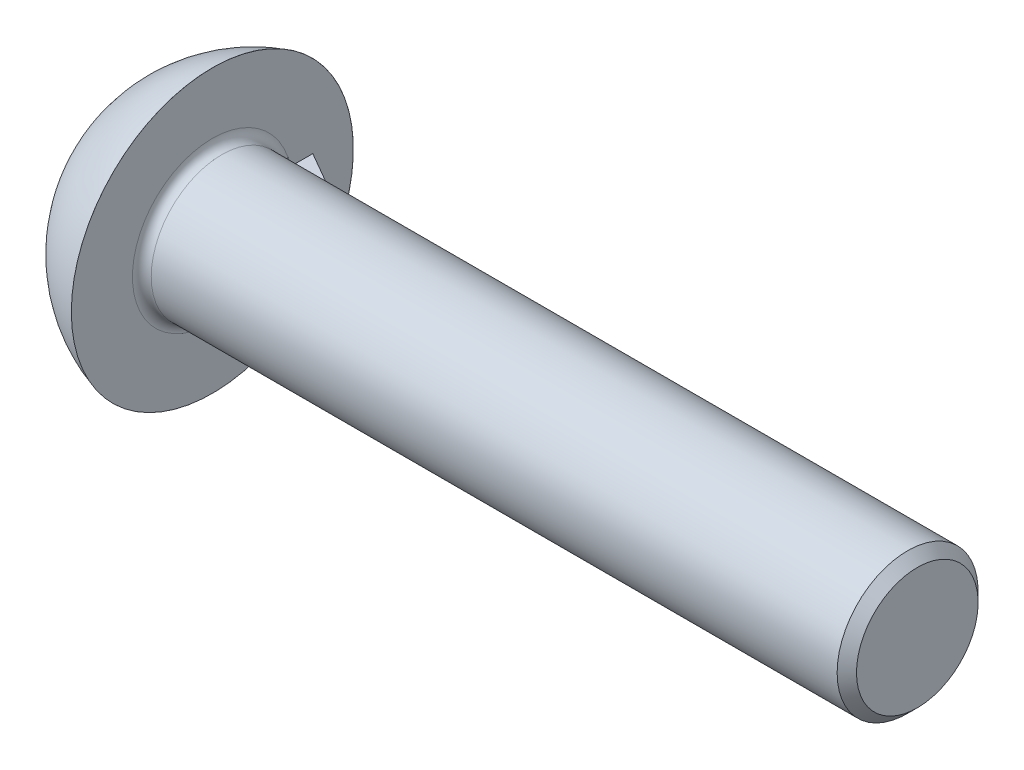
ISO-10303-21;
HEADER;
FILE_DESCRIPTION(('STEP AP214'),'2;1');
FILE_NAME('part.step','',(''),(''),'','','');
FILE_SCHEMA(('AUTOMOTIVE_DESIGN { 1 0 10303 214 1 1 1 1 }'));
ENDSEC;
DATA;
#1=APPLICATION_CONTEXT('core data for automotive mechanical design processes');
#2=APPLICATION_PROTOCOL_DEFINITION('international standard','automotive_design',2000,#1);
#3=PRODUCT_CONTEXT('',#1,'mechanical');
#4=PRODUCT('Part','Part','',(#3));
#5=PRODUCT_RELATED_PRODUCT_CATEGORY('part','',(#4));
#6=PRODUCT_DEFINITION_FORMATION('','',#4);
#7=PRODUCT_DEFINITION_CONTEXT('part definition',#1,'design');
#8=PRODUCT_DEFINITION('design','',#6,#7);
#9=PRODUCT_DEFINITION_SHAPE('','',#8);
#10=(LENGTH_UNIT() NAMED_UNIT(*) SI_UNIT(.MILLI.,.METRE.));
#11=(NAMED_UNIT(*) PLANE_ANGLE_UNIT() SI_UNIT($,.RADIAN.));
#12=(NAMED_UNIT(*) SI_UNIT($,.STERADIAN.) SOLID_ANGLE_UNIT());
#13=UNCERTAINTY_MEASURE_WITH_UNIT(LENGTH_MEASURE(1.E-05),#10,'distance_accuracy_value','');
#14=(GEOMETRIC_REPRESENTATION_CONTEXT(3) GLOBAL_UNCERTAINTY_ASSIGNED_CONTEXT((#13)) GLOBAL_UNIT_ASSIGNED_CONTEXT((#10,
#11,#12)) REPRESENTATION_CONTEXT('',''));
#15=CARTESIAN_POINT('',(0.,0.,0.));
#16=DIRECTION('',(0.,0.,1.));
#17=DIRECTION('',(1.,0.,0.));
#18=AXIS2_PLACEMENT_3D('',#15,#16,#17);
#19=CARTESIAN_POINT('',(18.,24.,0.));
#20=DIRECTION('',(-1.,0.,0.));
#21=DIRECTION('',(0.,0.,1.));
#22=AXIS2_PLACEMENT_3D('',#19,#20,#21);
#23=PLANE('',#22);
#24=CARTESIAN_POINT('',(18.,0.,0.));
#25=DIRECTION('',(-1.,0.,0.));
#26=DIRECTION('',(0.,0.,1.));
#27=AXIS2_PLACEMENT_3D('',#24,#25,#26);
#28=CIRCLE('',#27,13.6);
#29=CARTESIAN_POINT('',(18.,-2.8,-13.3086438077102));
#30=VERTEX_POINT('',#29);
#31=CARTESIAN_POINT('',(18.,2.8,-13.3086438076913));
#32=VERTEX_POINT('',#31);
#33=EDGE_CURVE('E76',#30,#32,#28,.T.);
#34=ORIENTED_EDGE('',*,*,#33,.T.);
#35=DIRECTION('',(0.,0.,1.));
#36=VECTOR('',#35,1.);
#37=CARTESIAN_POINT('',(18.,2.8,-17.1));
#38=LINE('',#37,#36);
#39=CARTESIAN_POINT('',(18.,2.8,-17.1));
#40=VERTEX_POINT('',#39);
#41=EDGE_CURVE('E51',#40,#32,#38,.T.);
#42=ORIENTED_EDGE('',*,*,#41,.F.);
#43=DIRECTION('',(0.,-1.,0.));
#44=VECTOR('',#43,1.);
#45=CARTESIAN_POINT('',(18.,2.8,-17.1));
#46=LINE('',#45,#44);
#47=CARTESIAN_POINT('',(18.,-2.8,-17.1));
#48=VERTEX_POINT('',#47);
#49=EDGE_CURVE('E56',#40,#48,#46,.T.);
#50=ORIENTED_EDGE('',*,*,#49,.T.);
#51=DIRECTION('',(0.,0.,1.));
#52=VECTOR('',#51,1.);
#53=CARTESIAN_POINT('',(18.,-2.8,-17.1));
#54=LINE('',#53,#52);
#55=EDGE_CURVE('E85',#48,#30,#54,.T.);
#56=ORIENTED_EDGE('',*,*,#55,.T.);
#57=EDGE_LOOP('',(#34,#42,#50,#56));
#58=FACE_BOUND('',#57,.T.);
#59=CARTESIAN_POINT('',(18.,0.,0.));
#60=DIRECTION('',(-1.,0.,0.));
#61=DIRECTION('',(0.,0.,1.));
#62=AXIS2_PLACEMENT_3D('',#59,#60,#61);
#63=CIRCLE('',#62,24.);
#64=CARTESIAN_POINT('',(18.,0.,24.));
#65=VERTEX_POINT('',#64);
#66=EDGE_CURVE('E136',#65,#65,#63,.T.);
#67=ORIENTED_EDGE('',*,*,#66,.F.);
#68=EDGE_LOOP('',(#67));
#69=FACE_BOUND('',#68,.T.);
#70=ADVANCED_FACE('F35',(#58,#69),#23,.F.);
#71=CARTESIAN_POINT('',(25.0000388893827,0.,0.));
#72=DIRECTION('',(-1.,0.,0.));
#73=DIRECTION('',(0.,1.,0.));
#74=AXIS2_PLACEMENT_3D('',#71,#72,#73);
#75=SPHERICAL_SURFACE('',#74,25.0000388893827);
#76=CARTESIAN_POINT('',(17.9999,0.,0.));
#77=DIRECTION('',(-1.,0.,0.));
#78=DIRECTION('',(0.,0.,1.));
#79=AXIS2_PLACEMENT_3D('',#76,#77,#78);
#80=CIRCLE('',#79,24.);
#81=CARTESIAN_POINT('',(17.9999,0.,24.));
#82=VERTEX_POINT('',#81);
#83=EDGE_CURVE('E135',#82,#82,#80,.T.);
#84=ORIENTED_EDGE('',*,*,#83,.T.);
#85=EDGE_LOOP('',(#84));
#86=FACE_BOUND('',#85,.T.);
#87=ADVANCED_FACE('F126',(#86),#75,.T.);
#88=CARTESIAN_POINT('',(-9.82817590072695,0.,0.));
#89=DIRECTION('',(-1.,0.,0.));
#90=DIRECTION('',(0.,0.,1.));
#91=AXIS2_PLACEMENT_3D('',#88,#89,#90);
#92=CYLINDRICAL_SURFACE('',#91,24.);
#93=ORIENTED_EDGE('',*,*,#83,.F.);
#94=EDGE_LOOP('',(#93));
#95=FACE_BOUND('',#94,.T.);
#96=ORIENTED_EDGE('',*,*,#66,.T.);
#97=EDGE_LOOP('',(#96));
#98=FACE_BOUND('',#97,.T.);
#99=ADVANCED_FACE('F122',(#95,#98),#92,.T.);
#100=CARTESIAN_POINT('',(138.,0.,-10.352));
#101=DIRECTION('',(-1.,0.,0.));
#102=DIRECTION('',(0.,0.,1.));
#103=AXIS2_PLACEMENT_3D('',#100,#101,#102);
#104=PLANE('',#103);
#105=CARTESIAN_POINT('',(138.,0.,0.));
#106=DIRECTION('',(-1.,0.,0.));
#107=DIRECTION('',(0.,0.,1.));
#108=AXIS2_PLACEMENT_3D('',#105,#106,#107);
#109=CIRCLE('',#108,10.352);
#110=CARTESIAN_POINT('',(138.,0.,10.352));
#111=VERTEX_POINT('',#110);
#112=EDGE_CURVE('E137',#111,#111,#109,.T.);
#113=ORIENTED_EDGE('',*,*,#112,.F.);
#114=EDGE_LOOP('',(#113));
#115=FACE_BOUND('',#114,.T.);
#116=ADVANCED_FACE('F118',(#115),#104,.F.);
#117=CARTESIAN_POINT('',(138.,0.,0.));
#118=DIRECTION('',(-1.,0.,0.));
#119=DIRECTION('',(0.,0.,1.));
#120=AXIS2_PLACEMENT_3D('',#117,#118,#119);
#121=CONICAL_SURFACE('',#120,10.352,0.785398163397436);
#122=CARTESIAN_POINT('',(136.352,0.,0.));
#123=DIRECTION('',(-1.,0.,0.));
#124=DIRECTION('',(0.,0.,1.));
#125=AXIS2_PLACEMENT_3D('',#122,#123,#124);
#126=CIRCLE('',#125,12.);
#127=CARTESIAN_POINT('',(136.352,0.,12.));
#128=VERTEX_POINT('',#127);
#129=EDGE_CURVE('E142',#128,#128,#126,.T.);
#130=ORIENTED_EDGE('',*,*,#129,.F.);
#131=EDGE_LOOP('',(#130));
#132=FACE_BOUND('',#131,.T.);
#133=ORIENTED_EDGE('',*,*,#112,.T.);
#134=EDGE_LOOP('',(#133));
#135=FACE_BOUND('',#134,.T.);
#136=ADVANCED_FACE('F114',(#132,#135),#121,.T.);
#137=CARTESIAN_POINT('',(-12.2854470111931,0.,0.));
#138=DIRECTION('',(-1.,0.,0.));
#139=DIRECTION('',(0.,0.,1.));
#140=AXIS2_PLACEMENT_3D('',#137,#138,#139);
#141=CYLINDRICAL_SURFACE('',#140,12.);
#142=CARTESIAN_POINT('',(47.6180688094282,0.,0.));
#143=DIRECTION('',(-0.499999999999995,0.,0.866025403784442));
#144=DIRECTION('',(-0.866025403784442,0.,-0.499999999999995));
#145=AXIS2_PLACEMENT_3D('',#142,#143,#144);
#146=ELLIPSE('',#145,24.0000000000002,12.);
#147=CARTESIAN_POINT('',(27.4071806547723,2.8,-11.6687617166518));
#148=VERTEX_POINT('',#147);
#149=CARTESIAN_POINT('',(27.4071806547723,-2.8,-11.6687617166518));
#150=VERTEX_POINT('',#149);
#151=EDGE_CURVE('E11',#148,#150,#146,.T.);
#152=ORIENTED_EDGE('',*,*,#151,.F.);
#153=DIRECTION('',(-1.,0.,0.));
#154=VECTOR('',#153,1.);
#155=CARTESIAN_POINT('',(-12.2854470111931,2.8,-11.6687617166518));
#156=LINE('',#155,#154);
#157=CARTESIAN_POINT('',(19.6,2.8,-11.6687617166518));
#158=VERTEX_POINT('',#157);
#159=EDGE_CURVE('E147',#148,#158,#156,.T.);
#160=ORIENTED_EDGE('',*,*,#159,.T.);
#161=CARTESIAN_POINT('',(19.6,0.,0.));
#162=DIRECTION('',(-1.,0.,0.));
#163=DIRECTION('',(0.,0.,1.));
#164=AXIS2_PLACEMENT_3D('',#161,#162,#163);
#165=CIRCLE('',#164,12.);
#166=CARTESIAN_POINT('',(19.6,-2.8,-11.6687617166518));
#167=VERTEX_POINT('',#166);
#168=EDGE_CURVE('E82',#158,#167,#165,.F.);
#169=ORIENTED_EDGE('',*,*,#168,.T.);
#170=DIRECTION('',(-1.,0.,0.));
#171=VECTOR('',#170,1.);
#172=CARTESIAN_POINT('',(-12.2854470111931,-2.8,-11.6687617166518));
#173=LINE('',#172,#171);
#174=EDGE_CURVE('E93',#150,#167,#173,.T.);
#175=ORIENTED_EDGE('',*,*,#174,.F.);
#176=EDGE_LOOP('',(#152,#160,#169,#175));
#177=FACE_BOUND('',#176,.T.);
#178=ORIENTED_EDGE('',*,*,#129,.T.);
#179=EDGE_LOOP('',(#178));
#180=FACE_BOUND('',#179,.T.);
#181=ADVANCED_FACE('F111',(#177,#180),#141,.T.);
#182=CARTESIAN_POINT('',(19.6,0.,0.));
#183=DIRECTION('',(-1.,0.,0.));
#184=DIRECTION('',(0.,0.,1.));
#185=AXIS2_PLACEMENT_3D('',#182,#183,#184);
#186=TOROIDAL_SURFACE('',#185,13.6,1.6);
#187=ORIENTED_EDGE('',*,*,#168,.F.);
#188=CARTESIAN_POINT('',(18.0202101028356,2.8,-13.0494818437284));
#189=CARTESIAN_POINT('',(18.005713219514,2.8,-13.1419052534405));
#190=CARTESIAN_POINT('',(17.9989768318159,2.8,-13.2356158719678));
#191=CARTESIAN_POINT('',(18.0012778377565,2.8,-13.4229256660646));
#192=CARTESIAN_POINT('',(18.0103347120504,2.8,-13.5165245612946));
#193=CARTESIAN_POINT('',(18.0440632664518,2.8,-13.7008716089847));
#194=CARTESIAN_POINT('',(18.0687335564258,2.8,-13.7916200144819));
#195=CARTESIAN_POINT('',(18.1330880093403,2.8,-13.9676036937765));
#196=CARTESIAN_POINT('',(18.1727677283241,2.8,-14.0528405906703));
#197=CARTESIAN_POINT('',(18.2657094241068,2.8,-14.2145800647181));
#198=CARTESIAN_POINT('',(18.31885079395,2.8,-14.2911518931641));
#199=CARTESIAN_POINT('',(18.4374564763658,2.8,-14.4340790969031));
#200=CARTESIAN_POINT('',(18.5029201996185,2.8,-14.5004349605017));
#201=CARTESIAN_POINT('',(18.6430464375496,2.8,-14.6197577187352));
#202=CARTESIAN_POINT('',(18.717521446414,2.8,-14.6729447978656));
#203=CARTESIAN_POINT('',(18.8744707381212,2.8,-14.7657994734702));
#204=CARTESIAN_POINT('',(18.9569441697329,2.8,-14.8054685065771));
#205=CARTESIAN_POINT('',(19.1260026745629,2.8,-14.8694604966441));
#206=CARTESIAN_POINT('',(19.2124913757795,2.8,-14.8940381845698));
#207=CARTESIAN_POINT('',(19.3883852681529,2.8,-14.9281476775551));
#208=CARTESIAN_POINT('',(19.4777902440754,2.8,-14.9376805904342));
#209=CARTESIAN_POINT('',(19.6559516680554,2.8,-14.9413806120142));
#210=CARTESIAN_POINT('',(19.7447047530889,2.8,-14.935711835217));
#211=CARTESIAN_POINT('',(19.919992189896,2.8,-14.9095350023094));
#212=CARTESIAN_POINT('',(20.0065265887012,2.8,-14.8890272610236));
#213=CARTESIAN_POINT('',(20.1748453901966,2.8,-14.833834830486));
#214=CARTESIAN_POINT('',(20.2566346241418,2.8,-14.7991648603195));
#215=CARTESIAN_POINT('',(20.4133010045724,2.8,-14.7167010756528));
#216=CARTESIAN_POINT('',(20.4881779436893,2.8,-14.6689068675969));
#217=CARTESIAN_POINT('',(20.6296267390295,2.8,-14.5611379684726));
#218=CARTESIAN_POINT('',(20.6961197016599,2.8,-14.5010597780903));
#219=CARTESIAN_POINT('',(20.8182699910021,2.8,-14.3707508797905));
#220=CARTESIAN_POINT('',(20.8739265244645,2.8,-14.3005194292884));
#221=CARTESIAN_POINT('',(20.9737921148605,2.8,-14.1507041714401));
#222=CARTESIAN_POINT('',(21.0178030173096,2.8,-14.070988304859));
#223=CARTESIAN_POINT('',(21.0920930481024,2.8,-13.9053980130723));
#224=CARTESIAN_POINT('',(21.122370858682,2.8,-13.8195229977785));
#225=CARTESIAN_POINT('',(21.1689060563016,2.8,-13.6423681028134));
#226=CARTESIAN_POINT('',(21.1848961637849,2.8,-13.5510179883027));
#227=CARTESIAN_POINT('',(21.2015429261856,2.8,-13.3669299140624));
#228=CARTESIAN_POINT('',(21.2021982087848,2.8,-13.2741918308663));
#229=CARTESIAN_POINT('',(21.1881002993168,2.8,-13.0886008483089));
#230=CARTESIAN_POINT('',(21.1731341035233,2.8,-12.9957640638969));
#231=CARTESIAN_POINT('',(21.1278691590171,2.8,-12.8139015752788));
#232=CARTESIAN_POINT('',(21.0975697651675,2.8,-12.7248760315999));
#233=CARTESIAN_POINT('',(21.0223364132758,2.8,-12.552993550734));
#234=CARTESIAN_POINT('',(20.9773698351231,2.8,-12.4701508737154));
#235=CARTESIAN_POINT('',(20.8739921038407,2.8,-12.3133198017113));
#236=CARTESIAN_POINT('',(20.8155816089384,2.8,-12.2393309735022));
#237=CARTESIAN_POINT('',(20.6877342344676,2.8,-12.1034115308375));
#238=CARTESIAN_POINT('',(20.6184524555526,2.8,-12.0413351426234));
#239=CARTESIAN_POINT('',(20.4702261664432,2.8,-11.9300461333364));
#240=CARTESIAN_POINT('',(20.391283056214,2.8,-11.8808316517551));
#241=CARTESIAN_POINT('',(20.2280463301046,2.8,-11.797966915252));
#242=CARTESIAN_POINT('',(20.143931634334,2.8,-11.7639642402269));
#243=CARTESIAN_POINT('',(19.9711053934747,2.8,-11.710946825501));
#244=CARTESIAN_POINT('',(19.882394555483,2.8,-11.6919297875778));
#245=CARTESIAN_POINT('',(19.7051162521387,2.8,-11.6698106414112));
#246=CARTESIAN_POINT('',(19.61659362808,2.8,-11.6663479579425));
#247=CARTESIAN_POINT('',(19.4402454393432,2.8,-11.6744703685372));
#248=CARTESIAN_POINT('',(19.3524198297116,2.8,-11.6860544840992));
#249=CARTESIAN_POINT('',(19.1806943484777,2.8,-11.7237187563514));
#250=CARTESIAN_POINT('',(19.0967682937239,2.8,-11.7496798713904));
#251=CARTESIAN_POINT('',(18.9343949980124,2.8,-11.8151643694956));
#252=CARTESIAN_POINT('',(18.8559477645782,2.8,-11.8546877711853));
#253=CARTESIAN_POINT('',(18.7057427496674,2.8,-11.9465897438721));
#254=CARTESIAN_POINT('',(18.6340725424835,2.8,-11.9991113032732));
#255=CARTESIAN_POINT('',(18.5002841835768,2.8,-12.1151939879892));
#256=CARTESIAN_POINT('',(18.4381694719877,2.8,-12.178759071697));
#257=CARTESIAN_POINT('',(18.3236524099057,2.8,-12.3167674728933));
#258=CARTESIAN_POINT('',(18.2715264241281,2.8,-12.3914398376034));
#259=CARTESIAN_POINT('',(18.1802658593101,2.8,-12.5482595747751));
#260=CARTESIAN_POINT('',(18.1411178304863,2.8,-12.6303990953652));
#261=CARTESIAN_POINT('',(18.0883930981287,2.8,-12.7691206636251));
#262=CARTESIAN_POINT('',(18.0706910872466,2.8,-12.8241736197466));
#263=CARTESIAN_POINT('',(18.0410760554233,2.8,-12.9358146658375));
#264=CARTESIAN_POINT('',(18.029163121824,2.8,-12.9924027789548));
#265=CARTESIAN_POINT('',(18.0202101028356,2.8,-13.0494818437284));
#266=B_SPLINE_CURVE_WITH_KNOTS('',3,(#188,#189,#190,#191,#192,#193,#194,#195,#196,#197,#198,
#199,#200,#201,#202,#203,#204,#205,#206,#207,#208,#209,#210,#211,#212,#213,#214,#215,#216,#217,
#218,#219,#220,#221,#222,#223,#224,#225,#226,#227,#228,#229,#230,#231,#232,#233,#234,#235,#236,
#237,#238,#239,#240,#241,#242,#243,#244,#245,#246,#247,#248,#249,#250,#251,#252,#253,#254,#255,
#256,#257,#258,#259,#260,#261,#262,#263,#264,#265),.UNSPECIFIED.,.T.,.F.,(4,2,2,2,2,2,2,2,2,2,2,
2,2,2,2,2,2,2,2,2,2,2,2,2,2,2,2,2,2,2,2,2,2,2,2,2,2,2,4),(0.,0.280451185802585,
0.561248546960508,0.842020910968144,1.12271020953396,1.40096856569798,1.67921361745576,
1.95243299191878,2.22562332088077,2.49406562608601,2.76248816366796,3.02802456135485,
3.293555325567,3.55881081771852,3.82407426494,4.09167231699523,4.35928995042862,
4.63120457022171,4.90314527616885,5.18007267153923,5.45702484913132,5.73780331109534,
6.01859358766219,6.30001265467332,6.58141794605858,6.85912268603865,7.13678723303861,
7.40763553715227,7.67844229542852,7.94293778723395,8.20741607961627,8.46973654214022,
8.73205736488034,8.99740324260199,9.26284442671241,9.53481237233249,9.8064975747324,
9.97969665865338,10.1528983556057),.UNSPECIFIED.);
#267=EDGE_CURVE('E44',#158,#32,#266,.T.);
#268=ORIENTED_EDGE('',*,*,#267,.T.);
#269=ORIENTED_EDGE('',*,*,#33,.F.);
#270=CARTESIAN_POINT('',(18.0202101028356,-2.8,-13.0494818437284));
#271=CARTESIAN_POINT('',(18.005713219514,-2.8,-13.1419052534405));
#272=CARTESIAN_POINT('',(17.9989768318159,-2.8,-13.2356158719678));
#273=CARTESIAN_POINT('',(18.0012778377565,-2.8,-13.4229256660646));
#274=CARTESIAN_POINT('',(18.0103347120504,-2.8,-13.5165245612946));
#275=CARTESIAN_POINT('',(18.0440632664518,-2.8,-13.7008716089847));
#276=CARTESIAN_POINT('',(18.0687335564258,-2.8,-13.7916200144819));
#277=CARTESIAN_POINT('',(18.1330880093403,-2.8,-13.9676036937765));
#278=CARTESIAN_POINT('',(18.1727677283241,-2.8,-14.0528405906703));
#279=CARTESIAN_POINT('',(18.2657094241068,-2.8,-14.2145800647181));
#280=CARTESIAN_POINT('',(18.31885079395,-2.8,-14.2911518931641));
#281=CARTESIAN_POINT('',(18.4374564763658,-2.8,-14.4340790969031));
#282=CARTESIAN_POINT('',(18.5029201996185,-2.8,-14.5004349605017));
#283=CARTESIAN_POINT('',(18.6430464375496,-2.8,-14.6197577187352));
#284=CARTESIAN_POINT('',(18.717521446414,-2.8,-14.6729447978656));
#285=CARTESIAN_POINT('',(18.8744707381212,-2.8,-14.7657994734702));
#286=CARTESIAN_POINT('',(18.9569441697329,-2.8,-14.8054685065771));
#287=CARTESIAN_POINT('',(19.1260026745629,-2.8,-14.8694604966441));
#288=CARTESIAN_POINT('',(19.2124913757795,-2.8,-14.8940381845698));
#289=CARTESIAN_POINT('',(19.3883852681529,-2.8,-14.9281476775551));
#290=CARTESIAN_POINT('',(19.4777902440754,-2.8,-14.9376805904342));
#291=CARTESIAN_POINT('',(19.6559516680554,-2.8,-14.9413806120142));
#292=CARTESIAN_POINT('',(19.7447047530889,-2.8,-14.935711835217));
#293=CARTESIAN_POINT('',(19.919992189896,-2.8,-14.9095350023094));
#294=CARTESIAN_POINT('',(20.0065265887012,-2.8,-14.8890272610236));
#295=CARTESIAN_POINT('',(20.1748453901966,-2.8,-14.833834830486));
#296=CARTESIAN_POINT('',(20.2566346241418,-2.8,-14.7991648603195));
#297=CARTESIAN_POINT('',(20.4133010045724,-2.8,-14.7167010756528));
#298=CARTESIAN_POINT('',(20.4881779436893,-2.8,-14.6689068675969));
#299=CARTESIAN_POINT('',(20.6296267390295,-2.8,-14.5611379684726));
#300=CARTESIAN_POINT('',(20.6961197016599,-2.8,-14.5010597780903));
#301=CARTESIAN_POINT('',(20.8182699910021,-2.8,-14.3707508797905));
#302=CARTESIAN_POINT('',(20.8739265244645,-2.8,-14.3005194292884));
#303=CARTESIAN_POINT('',(20.9737921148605,-2.8,-14.1507041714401));
#304=CARTESIAN_POINT('',(21.0178030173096,-2.8,-14.070988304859));
#305=CARTESIAN_POINT('',(21.0920930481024,-2.8,-13.9053980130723));
#306=CARTESIAN_POINT('',(21.122370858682,-2.8,-13.8195229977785));
#307=CARTESIAN_POINT('',(21.1689060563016,-2.8,-13.6423681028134));
#308=CARTESIAN_POINT('',(21.1848961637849,-2.8,-13.5510179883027));
#309=CARTESIAN_POINT('',(21.2015429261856,-2.8,-13.3669299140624));
#310=CARTESIAN_POINT('',(21.2021982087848,-2.8,-13.2741918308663));
#311=CARTESIAN_POINT('',(21.1881002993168,-2.8,-13.0886008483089));
#312=CARTESIAN_POINT('',(21.1731341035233,-2.8,-12.9957640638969));
#313=CARTESIAN_POINT('',(21.1278691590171,-2.8,-12.8139015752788));
#314=CARTESIAN_POINT('',(21.0975697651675,-2.8,-12.7248760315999));
#315=CARTESIAN_POINT('',(21.0223364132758,-2.8,-12.552993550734));
#316=CARTESIAN_POINT('',(20.9773698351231,-2.8,-12.4701508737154));
#317=CARTESIAN_POINT('',(20.8739921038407,-2.8,-12.3133198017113));
#318=CARTESIAN_POINT('',(20.8155816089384,-2.8,-12.2393309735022));
#319=CARTESIAN_POINT('',(20.6877342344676,-2.8,-12.1034115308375));
#320=CARTESIAN_POINT('',(20.6184524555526,-2.8,-12.0413351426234));
#321=CARTESIAN_POINT('',(20.4702261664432,-2.8,-11.9300461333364));
#322=CARTESIAN_POINT('',(20.391283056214,-2.8,-11.8808316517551));
#323=CARTESIAN_POINT('',(20.2280463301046,-2.8,-11.797966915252));
#324=CARTESIAN_POINT('',(20.143931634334,-2.8,-11.7639642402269));
#325=CARTESIAN_POINT('',(19.9711053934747,-2.8,-11.710946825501));
#326=CARTESIAN_POINT('',(19.882394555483,-2.8,-11.6919297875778));
#327=CARTESIAN_POINT('',(19.7051162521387,-2.8,-11.6698106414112));
#328=CARTESIAN_POINT('',(19.61659362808,-2.8,-11.6663479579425));
#329=CARTESIAN_POINT('',(19.4402454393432,-2.8,-11.6744703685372));
#330=CARTESIAN_POINT('',(19.3524198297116,-2.8,-11.6860544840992));
#331=CARTESIAN_POINT('',(19.1806943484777,-2.8,-11.7237187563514));
#332=CARTESIAN_POINT('',(19.0967682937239,-2.8,-11.7496798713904));
#333=CARTESIAN_POINT('',(18.9343949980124,-2.8,-11.8151643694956));
#334=CARTESIAN_POINT('',(18.8559477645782,-2.8,-11.8546877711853));
#335=CARTESIAN_POINT('',(18.7057427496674,-2.8,-11.9465897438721));
#336=CARTESIAN_POINT('',(18.6340725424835,-2.8,-11.9991113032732));
#337=CARTESIAN_POINT('',(18.5002841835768,-2.8,-12.1151939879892));
#338=CARTESIAN_POINT('',(18.4381694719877,-2.8,-12.178759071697));
#339=CARTESIAN_POINT('',(18.3236524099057,-2.8,-12.3167674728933));
#340=CARTESIAN_POINT('',(18.2715264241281,-2.8,-12.3914398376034));
#341=CARTESIAN_POINT('',(18.1802658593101,-2.8,-12.5482595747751));
#342=CARTESIAN_POINT('',(18.1411178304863,-2.8,-12.6303990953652));
#343=CARTESIAN_POINT('',(18.0883930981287,-2.8,-12.7691206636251));
#344=CARTESIAN_POINT('',(18.0706910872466,-2.8,-12.8241736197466));
#345=CARTESIAN_POINT('',(18.0410760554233,-2.8,-12.9358146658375));
#346=CARTESIAN_POINT('',(18.029163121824,-2.8,-12.9924027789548));
#347=CARTESIAN_POINT('',(18.0202101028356,-2.8,-13.0494818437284));
#348=B_SPLINE_CURVE_WITH_KNOTS('',3,(#270,#271,#272,#273,#274,#275,#276,#277,#278,#279,#280,
#281,#282,#283,#284,#285,#286,#287,#288,#289,#290,#291,#292,#293,#294,#295,#296,#297,#298,#299,
#300,#301,#302,#303,#304,#305,#306,#307,#308,#309,#310,#311,#312,#313,#314,#315,#316,#317,#318,
#319,#320,#321,#322,#323,#324,#325,#326,#327,#328,#329,#330,#331,#332,#333,#334,#335,#336,#337,
#338,#339,#340,#341,#342,#343,#344,#345,#346,#347),.UNSPECIFIED.,.T.,.F.,(4,2,2,2,2,2,2,2,2,2,2,
2,2,2,2,2,2,2,2,2,2,2,2,2,2,2,2,2,2,2,2,2,2,2,2,2,2,2,4),(0.,0.280451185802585,
0.561248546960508,0.842020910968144,1.12271020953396,1.40096856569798,1.67921361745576,
1.95243299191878,2.22562332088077,2.49406562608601,2.76248816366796,3.02802456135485,
3.293555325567,3.55881081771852,3.82407426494,4.09167231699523,4.35928995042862,
4.63120457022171,4.90314527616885,5.18007267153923,5.45702484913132,5.73780331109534,
6.01859358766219,6.30001265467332,6.58141794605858,6.85912268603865,7.13678723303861,
7.40763553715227,7.67844229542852,7.94293778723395,8.20741607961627,8.46973654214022,
8.73205736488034,8.99740324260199,9.26284442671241,9.53481237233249,9.8064975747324,
9.97969665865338,10.1528983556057),.UNSPECIFIED.);
#349=EDGE_CURVE('E79',#167,#30,#348,.T.);
#350=ORIENTED_EDGE('',*,*,#349,.F.);
#351=EDGE_LOOP('',(#187,#268,#269,#350));
#352=FACE_BOUND('',#351,.T.);
#353=ADVANCED_FACE('F37',(#352),#186,.F.);
#354=CARTESIAN_POINT('',(18.,2.8,-17.1));
#355=DIRECTION('',(-0.499999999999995,0.,0.866025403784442));
#356=DIRECTION('',(0.866025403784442,0.,0.499999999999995));
#357=AXIS2_PLACEMENT_3D('',#354,#355,#356);
#358=PLANE('',#357);
#359=DIRECTION('',(-0.866025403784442,0.,-0.499999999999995));
#360=VECTOR('',#359,1.);
#361=CARTESIAN_POINT('',(18.,2.8,-17.1));
#362=LINE('',#361,#360);
#363=EDGE_CURVE('E150',#148,#40,#362,.T.);
#364=ORIENTED_EDGE('',*,*,#363,.F.);
#365=ORIENTED_EDGE('',*,*,#151,.T.);
#366=DIRECTION('',(-0.866025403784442,0.,-0.499999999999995));
#367=VECTOR('',#366,1.);
#368=CARTESIAN_POINT('',(18.,-2.8,-17.1));
#369=LINE('',#368,#367);
#370=EDGE_CURVE('E89',#150,#48,#369,.T.);
#371=ORIENTED_EDGE('',*,*,#370,.T.);
#372=ORIENTED_EDGE('',*,*,#49,.F.);
#373=EDGE_LOOP('',(#364,#365,#371,#372));
#374=FACE_BOUND('',#373,.T.);
#375=ADVANCED_FACE('F107',(#374),#358,.F.);
#376=CARTESIAN_POINT('',(18.,2.8,0.));
#377=DIRECTION('',(0.,1.,0.));
#378=DIRECTION('',(0.,0.,1.));
#379=AXIS2_PLACEMENT_3D('',#376,#377,#378);
#380=PLANE('',#379);
#381=ORIENTED_EDGE('',*,*,#159,.F.);
#382=ORIENTED_EDGE('',*,*,#363,.T.);
#383=ORIENTED_EDGE('',*,*,#41,.T.);
#384=ORIENTED_EDGE('',*,*,#267,.F.);
#385=EDGE_LOOP('',(#381,#382,#383,#384));
#386=FACE_BOUND('',#385,.T.);
#387=ADVANCED_FACE('F105',(#386),#380,.T.);
#388=CARTESIAN_POINT('',(18.,-2.8,0.));
#389=DIRECTION('',(0.,1.,0.));
#390=DIRECTION('',(0.,0.,1.));
#391=AXIS2_PLACEMENT_3D('',#388,#389,#390);
#392=PLANE('',#391);
#393=ORIENTED_EDGE('',*,*,#370,.F.);
#394=ORIENTED_EDGE('',*,*,#174,.T.);
#395=ORIENTED_EDGE('',*,*,#349,.T.);
#396=ORIENTED_EDGE('',*,*,#55,.F.);
#397=EDGE_LOOP('',(#393,#394,#395,#396));
#398=FACE_BOUND('',#397,.T.);
#399=ADVANCED_FACE('F92',(#398),#392,.F.);
#400=CLOSED_SHELL('',(#70,#87,#99,#116,#136,#181,#353,#375,#387,#399));
#401=MANIFOLD_SOLID_BREP('B2',#400);
#402=ADVANCED_BREP_SHAPE_REPRESENTATION('',(#18,#401),#14);
#403=SHAPE_DEFINITION_REPRESENTATION(#9,#402);
ENDSEC;
END-ISO-10303-21;
